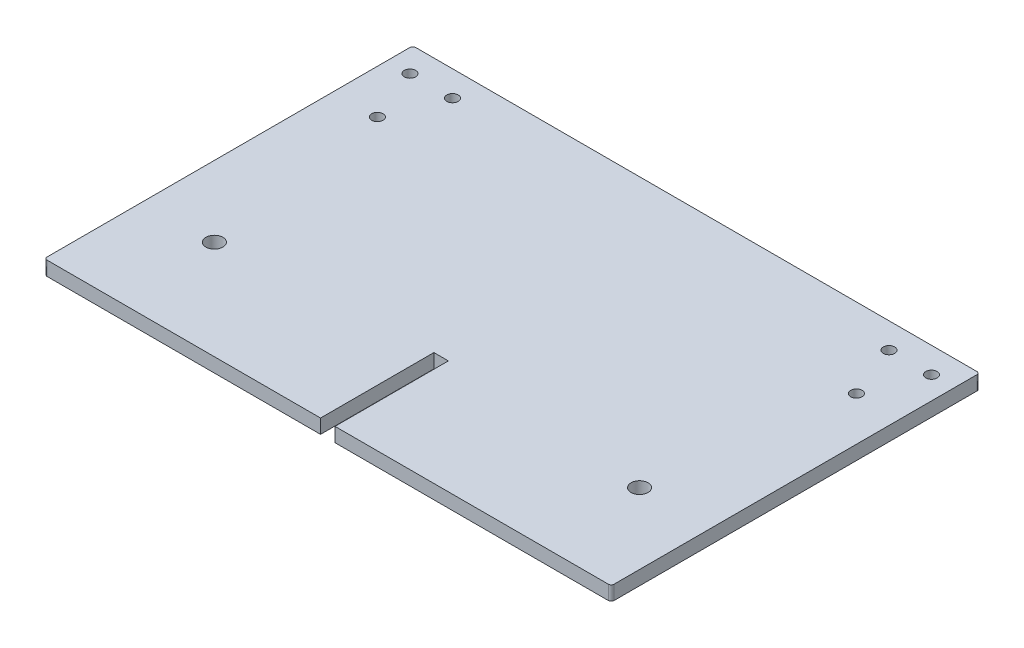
from build123d import *

# Parameters (mm, degrees)
SKETCH1_R           = 2
SKETCH1_R_2         = 3
BOSS_EXTRUDE1_DEPTH = 5
FILLET1_R           = 1


with BuildPart() as part:
    # Sketch1 → Boss-Extrude1 (new body)
    with BuildSketch(Plane(origin=(0, 0, 0), x_dir=(1, 0, 0), z_dir=(0, 1, 0))):
        Polygon((0, 0), (200, 0), (200, -130), (102.55, -130), (102.55, -90), (97.45, -90), (97.45, -130), (0, -130), align=None)
        with Locations(Location((8, -9, 0), (0, 0, 270))):
            Circle(SKETCH1_R, mode=Mode.SUBTRACT)
        with Locations(Location((23, -9, 0), (0, 0, 270))):
            Circle(SKETCH1_R, mode=Mode.SUBTRACT)
        with Locations(Location((15.5, -28, 0), (0, 0, 270))):
            Circle(SKETCH1_R, mode=Mode.SUBTRACT)
        with Locations(Location((25, -95, 0), (0, 0, 270))):
            Circle(SKETCH1_R_2, mode=Mode.SUBTRACT)
        with Locations(Location((175, -95, 0), (0, 0, 90))):
            Circle(SKETCH1_R_2, mode=Mode.SUBTRACT)
        with Locations(Location((184.5, -28, 0), (0, 0, 90))):
            Circle(SKETCH1_R, mode=Mode.SUBTRACT)
        with Locations(Location((177, -9, 0), (0, 0, 90))):
            Circle(SKETCH1_R, mode=Mode.SUBTRACT)
        with Locations(Location((192, -9, 0), (0, 0, 90))):
            Circle(SKETCH1_R, mode=Mode.SUBTRACT)
    extrude(amount=BOSS_EXTRUDE1_DEPTH)

    # Fillet1
    fillet1_edges = [part.edges().sort_by_distance(p)[0] for p in [
        (0, 2.5, 0),
        (200, 2.5, 0),
        (200, 2.5, 130),
        (0, 2.5, 130),
    ]]
    fillet(fillet1_edges, radius=FILLET1_R)


solid = part.part
